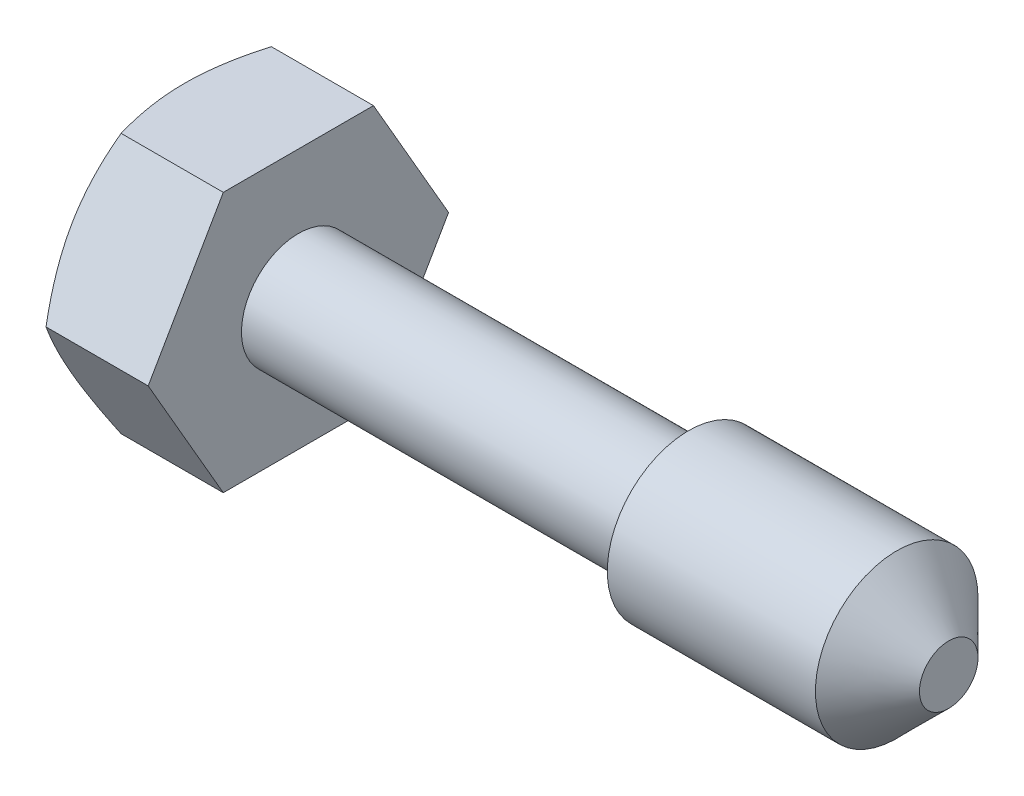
from build123d import *

# Parameters (mm, degrees)
BASEHEAD_DEPTH = 3.5
SKETCH2_R      = 1.75
BASEBODY_DEPTH = 20
SKETCH3_R      = 2.5
BASEEND_DEPTH  = 8
CHAMFER1_SIZE  = 1.6


with BuildPart() as part:
    # Sketch1 → BaseHead (new body)
    with BuildSketch(Plane(origin=(0, 0, 0), x_dir=(0, 0, -1), z_dir=(1, 0, 0))):
        Polygon((-2.309401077, 4), (-4.618802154, 0), (-2.309401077, -4), (2.309401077, -4), (4.618802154, 0), (2.309401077, 4), align=None)
    extrude(amount=BASEHEAD_DEPTH)

    # Sketch2 → BaseBody (add)
    with BuildSketch(Plane(origin=(3.5, 0.514943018, -0.975530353), x_dir=(0, 0, -1), z_dir=(1, 0, 0))):
        with Locations((-0.975530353, -0.514943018)):
            Circle(SKETCH2_R)
    extrude(amount=BASEBODY_DEPTH)

    # Sketch3 → BaseEnd (add)
    with BuildSketch(Plane(origin=(23.5, -0.570828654, -0.34912767), x_dir=(0, 0, -1), z_dir=(1, 0, 0))):
        with Locations((-0.34912767, 0.570828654)):
            Circle(SKETCH3_R)
    extrude(amount=-BASEEND_DEPTH)

    # Chamfer1
    chamfer1_edges = [part.edges().sort_by_distance(p)[0] for p in [
        (23.5, 0, 2.5),
    ]]
    chamfer(chamfer1_edges, length=CHAMFER1_SIZE)

    # Sketch4 → Cut-Revolve1 (revolve, cut)
    with BuildSketch(Plane(origin=(4.324248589, 0, -10.294553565), x_dir=(0, 0, 1), z_dir=(0, 1, 0))):
        Polygon((14.294553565, -4.324248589), (24.913355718, 1.806519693), (24.913355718, -4.324248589), align=None)
    revolve(axis=Axis((15.815679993, 0, 0), (-1, 0, 0)), mode=Mode.SUBTRACT)


solid = part.part
